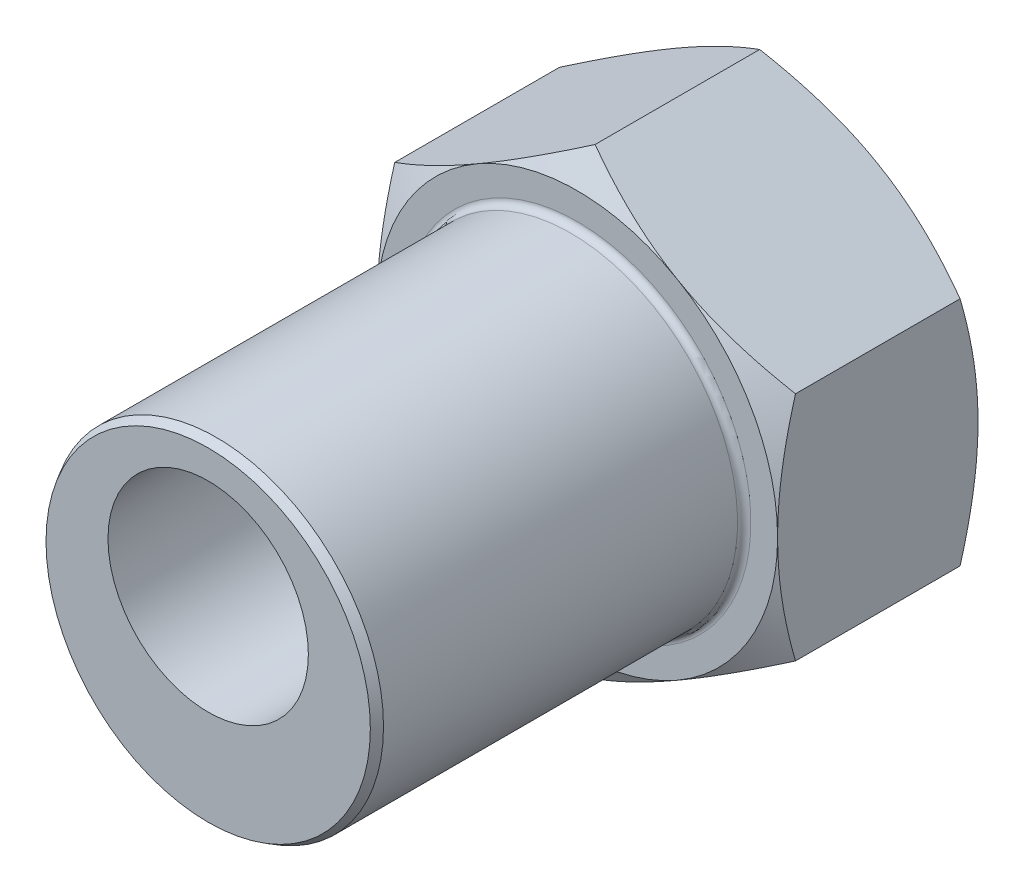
ISO-10303-21;
HEADER;
FILE_DESCRIPTION(('STEP AP214'),'2;1');
FILE_NAME('part.step','',(''),(''),'','','');
FILE_SCHEMA(('AUTOMOTIVE_DESIGN { 1 0 10303 214 1 1 1 1 }'));
ENDSEC;
DATA;
#1=APPLICATION_CONTEXT('core data for automotive mechanical design processes');
#2=APPLICATION_PROTOCOL_DEFINITION('international standard','automotive_design',2000,#1);
#3=PRODUCT_CONTEXT('',#1,'mechanical');
#4=PRODUCT('Part','Part','',(#3));
#5=PRODUCT_RELATED_PRODUCT_CATEGORY('part','',(#4));
#6=PRODUCT_DEFINITION_FORMATION('','',#4);
#7=PRODUCT_DEFINITION_CONTEXT('part definition',#1,'design');
#8=PRODUCT_DEFINITION('design','',#6,#7);
#9=PRODUCT_DEFINITION_SHAPE('','',#8);
#10=(LENGTH_UNIT() NAMED_UNIT(*) SI_UNIT(.MILLI.,.METRE.));
#11=(NAMED_UNIT(*) PLANE_ANGLE_UNIT() SI_UNIT($,.RADIAN.));
#12=(NAMED_UNIT(*) SI_UNIT($,.STERADIAN.) SOLID_ANGLE_UNIT());
#13=UNCERTAINTY_MEASURE_WITH_UNIT(LENGTH_MEASURE(1.E-05),#10,'distance_accuracy_value','');
#14=(GEOMETRIC_REPRESENTATION_CONTEXT(3) GLOBAL_UNCERTAINTY_ASSIGNED_CONTEXT((#13)) GLOBAL_UNIT_ASSIGNED_CONTEXT((#10,
#11,#12)) REPRESENTATION_CONTEXT('',''));
#15=CARTESIAN_POINT('',(0.,0.,0.));
#16=DIRECTION('',(0.,0.,1.));
#17=DIRECTION('',(1.,0.,0.));
#18=AXIS2_PLACEMENT_3D('',#15,#16,#17);
#19=CARTESIAN_POINT('',(-12.,4.92820323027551,12.));
#20=DIRECTION('',(-0.5,0.866025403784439,0.));
#21=DIRECTION('',(0.866025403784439,0.5,0.));
#22=AXIS2_PLACEMENT_3D('',#19,#20,#21);
#23=PLANE('',#22);
#24=DIRECTION('',(0.,0.,-1.));
#25=VECTOR('',#24,1.);
#26=CARTESIAN_POINT('',(0.,11.856406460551,12.));
#27=LINE('',#26,#25);
#28=CARTESIAN_POINT('',(0.,11.856406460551,10.9282032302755));
#29=VERTEX_POINT('',#28);
#30=CARTESIAN_POINT('',(0.,11.856406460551,1.07179676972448));
#31=VERTEX_POINT('',#30);
#32=EDGE_CURVE('E231',#29,#31,#27,.T.);
#33=ORIENTED_EDGE('',*,*,#32,.T.);
#34=CARTESIAN_POINT('',(0.000200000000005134,11.8565219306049,1.07186343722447));
#35=CARTESIAN_POINT('',(-0.263585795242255,11.7042251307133,0.983949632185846));
#36=CARTESIAN_POINT('',(-0.528355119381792,11.5513604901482,0.900025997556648));
#37=CARTESIAN_POINT('',(-1.06001701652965,11.244405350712,0.741266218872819));
#38=CARTESIAN_POINT('',(-1.32691025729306,11.0903144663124,0.666433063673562));
#39=CARTESIAN_POINT('',(-2.131890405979,10.6255589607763,0.457017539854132));
#40=CARTESIAN_POINT('',(-2.6731550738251,10.3130596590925,0.337903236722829));
#41=CARTESIAN_POINT('',(-3.48313282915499,9.84541878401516,0.198231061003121));
#42=CARTESIAN_POINT('',(-3.74942610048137,9.69167429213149,0.15844379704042));
#43=CARTESIAN_POINT('',(-4.28324559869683,9.38347346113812,0.0917233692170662));
#44=CARTESIAN_POINT('',(-4.55077184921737,9.2290171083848,0.0647904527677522));
#45=CARTESIAN_POINT('',(-5.08627036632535,8.91984689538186,0.0244685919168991));
#46=CARTESIAN_POINT('',(-5.35424172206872,8.76513356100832,0.0110635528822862));
#47=CARTESIAN_POINT('',(-5.89043273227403,8.45556353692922,-0.00191690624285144));
#48=CARTESIAN_POINT('',(-6.15865237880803,8.30070685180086,-0.00149275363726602));
#49=CARTESIAN_POINT('',(-6.6600893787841,8.01120206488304,0.0122200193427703));
#50=CARTESIAN_POINT('',(-6.89334249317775,7.87653331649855,0.0238359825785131));
#51=CARTESIAN_POINT('',(-7.35931224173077,7.60750555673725,0.0573080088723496));
#52=CARTESIAN_POINT('',(-7.59202883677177,7.47314656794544,0.0791647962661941));
#53=CARTESIAN_POINT('',(-8.05679907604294,7.20481134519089,0.132737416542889));
#54=CARTESIAN_POINT('',(-8.288852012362,7.07083551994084,0.164461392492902));
#55=CARTESIAN_POINT('',(-8.75186996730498,6.80351197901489,0.237211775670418));
#56=CARTESIAN_POINT('',(-8.98283491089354,6.67016430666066,0.278238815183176));
#57=CARTESIAN_POINT('',(-9.68394195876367,6.2653799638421,0.416311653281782));
#58=CARTESIAN_POINT('',(-10.1520537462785,5.99511549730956,0.527124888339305));
#59=CARTESIAN_POINT('',(-11.0812971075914,5.45861659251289,0.778625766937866));
#60=CARTESIAN_POINT('',(-11.5424405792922,5.19237528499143,0.919254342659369));
#61=CARTESIAN_POINT('',(-12.0002,4.92808776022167,1.07186343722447));
#62=B_SPLINE_CURVE_WITH_KNOTS('',3,(#34,#35,#36,#37,#38,#39,#40,#41,#42,#43,#44,#45,#46,#47,#48,
#49,#50,#51,#52,#53,#54,#55,#56,#57,#58,#59,#60,#61),.UNSPECIFIED.,.F.,.F.,(4,2,2,2,2,2,2,2,2,2,
2,2,2,4),(0.,0.951004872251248,1.90232158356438,3.80900466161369,4.73894551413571,
5.6689042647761,6.59775529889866,7.52657763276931,8.3351464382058,9.1437724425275,
9.95306755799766,10.7624176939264,12.4167102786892,14.0677556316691),.UNSPECIFIED.);
#63=CARTESIAN_POINT('',(-6.,8.39230484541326,0.));
#64=VERTEX_POINT('',#63);
#65=EDGE_CURVE('E36',#31,#64,#62,.T.);
#66=ORIENTED_EDGE('',*,*,#65,.T.);
#67=CARTESIAN_POINT('',(-12.,4.92820323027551,1.07179676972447));
#68=VERTEX_POINT('',#67);
#69=EDGE_CURVE('E187',#64,#68,#62,.T.);
#70=ORIENTED_EDGE('',*,*,#69,.T.);
#71=DIRECTION('',(0.,0.,-1.));
#72=VECTOR('',#71,1.);
#73=CARTESIAN_POINT('',(-12.,4.92820323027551,12.));
#74=LINE('',#73,#72);
#75=CARTESIAN_POINT('',(-12.,4.92820323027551,10.9282032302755));
#76=VERTEX_POINT('',#75);
#77=EDGE_CURVE('E235',#76,#68,#74,.T.);
#78=ORIENTED_EDGE('',*,*,#77,.F.);
#79=CARTESIAN_POINT('',(-12.0002,4.92808776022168,10.9281365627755));
#80=CARTESIAN_POINT('',(-11.7364142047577,5.08038456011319,11.0160503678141));
#81=CARTESIAN_POINT('',(-11.4716448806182,5.23324920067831,11.0999740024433));
#82=CARTESIAN_POINT('',(-10.9399829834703,5.54020434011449,11.2587337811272));
#83=CARTESIAN_POINT('',(-10.6730897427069,5.69429522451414,11.3335669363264));
#84=CARTESIAN_POINT('',(-9.86810959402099,6.15905073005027,11.5429824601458));
#85=CARTESIAN_POINT('',(-9.3268449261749,6.47155003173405,11.6620967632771));
#86=CARTESIAN_POINT('',(-8.516867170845,6.93919090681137,11.8017689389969));
#87=CARTESIAN_POINT('',(-8.25057389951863,7.09293539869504,11.8415562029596));
#88=CARTESIAN_POINT('',(-7.71675440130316,7.40113622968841,11.9082766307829));
#89=CARTESIAN_POINT('',(-7.44922815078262,7.55559258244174,11.9352095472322));
#90=CARTESIAN_POINT('',(-6.91372963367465,7.86476279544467,11.9755314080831));
#91=CARTESIAN_POINT('',(-6.64575827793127,8.01947612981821,11.9889364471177));
#92=CARTESIAN_POINT('',(-6.10956726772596,8.32904615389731,12.0019169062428));
#93=CARTESIAN_POINT('',(-5.84134762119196,8.48390283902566,12.0014927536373));
#94=CARTESIAN_POINT('',(-5.33991062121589,8.77340762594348,11.9877799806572));
#95=CARTESIAN_POINT('',(-5.10665750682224,8.90807637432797,11.9761640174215));
#96=CARTESIAN_POINT('',(-4.64068775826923,9.17710413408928,11.9426919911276));
#97=CARTESIAN_POINT('',(-4.40797116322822,9.31146312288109,11.9208352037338));
#98=CARTESIAN_POINT('',(-3.94320092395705,9.57979834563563,11.8672625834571));
#99=CARTESIAN_POINT('',(-3.71114798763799,9.71377417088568,11.8355386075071));
#100=CARTESIAN_POINT('',(-3.24813003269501,9.98109771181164,11.7627882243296));
#101=CARTESIAN_POINT('',(-3.01716508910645,10.1144453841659,11.7217611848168));
#102=CARTESIAN_POINT('',(-2.31605804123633,10.5192297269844,11.5836883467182));
#103=CARTESIAN_POINT('',(-1.84794625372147,10.789494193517,11.4728751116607));
#104=CARTESIAN_POINT('',(-0.918702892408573,11.3259930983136,11.2213742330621));
#105=CARTESIAN_POINT('',(-0.457559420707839,11.5922344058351,11.0807456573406));
#106=CARTESIAN_POINT('',(0.000200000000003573,11.8565219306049,10.9281365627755));
#107=B_SPLINE_CURVE_WITH_KNOTS('',3,(#79,#80,#81,#82,#83,#84,#85,#86,#87,#88,#89,#90,#91,#92,
#93,#94,#95,#96,#97,#98,#99,#100,#101,#102,#103,#104,#105,#106),.UNSPECIFIED.,.F.,.F.,(4,2,2,2,
2,2,2,2,2,2,2,2,2,4),(0.,0.951004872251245,1.90232158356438,3.80900466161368,4.7389455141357,
5.66890426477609,6.59775529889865,7.5265776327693,8.33514643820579,9.14377244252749,
9.95306755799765,10.7624176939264,12.4167102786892,14.0677556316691),.UNSPECIFIED.);
#108=CARTESIAN_POINT('',(-6.,8.39230484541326,12.));
#109=VERTEX_POINT('',#108);
#110=EDGE_CURVE('E284',#76,#109,#107,.T.);
#111=ORIENTED_EDGE('',*,*,#110,.T.);
#112=EDGE_CURVE('E277',#109,#29,#107,.T.);
#113=ORIENTED_EDGE('',*,*,#112,.T.);
#114=EDGE_LOOP('',(#33,#66,#70,#78,#111,#113));
#115=FACE_BOUND('',#114,.T.);
#116=ADVANCED_FACE('F14',(#115),#23,.T.);
#117=CARTESIAN_POINT('',(-12.,-8.92820323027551,12.));
#118=DIRECTION('',(-1.,0.,0.));
#119=DIRECTION('',(0.,1.,0.));
#120=AXIS2_PLACEMENT_3D('',#117,#118,#119);
#121=PLANE('',#120);
#122=ORIENTED_EDGE('',*,*,#77,.T.);
#123=CARTESIAN_POINT('',(-12.,-20.6907209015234,5.89551240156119));
#124=CARTESIAN_POINT('',(-12.,-20.4283357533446,5.76803839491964));
#125=CARTESIAN_POINT('',(-12.,-20.165644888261,5.64119395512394));
#126=CARTESIAN_POINT('',(-12.,-19.6395879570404,5.38890663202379));
#127=CARTESIAN_POINT('',(-12.,-19.3762218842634,5.26346376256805));
#128=CARTESIAN_POINT('',(-12.,-18.5849461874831,4.88941860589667));
#129=CARTESIAN_POINT('',(-12.,-18.0559354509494,4.64313697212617));
#130=CARTESIAN_POINT('',(-12.,-16.9915603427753,4.15692725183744));
#131=CARTESIAN_POINT('',(-12.,-16.4561771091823,3.91704035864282));
#132=CARTESIAN_POINT('',(-12.,-15.3811812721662,3.44697197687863));
#133=CARTESIAN_POINT('',(-12.,-14.8415688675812,3.21679003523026));
#134=CARTESIAN_POINT('',(-12.,-13.73950431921,2.7613608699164));
#135=CARTESIAN_POINT('',(-12.,-13.1768826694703,2.53652170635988));
#136=CARTESIAN_POINT('',(-12.,-12.0450829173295,2.10366452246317));
#137=CARTESIAN_POINT('',(-12.,-11.4759040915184,1.89564837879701));
#138=CARTESIAN_POINT('',(-12.,-10.3311424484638,1.50184236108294));
#139=CARTESIAN_POINT('',(-12.,-9.75557499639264,1.31600817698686));
#140=CARTESIAN_POINT('',(-12.,-8.59612958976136,0.972465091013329));
#141=CARTESIAN_POINT('',(-12.,-8.01225428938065,0.814747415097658));
#142=CARTESIAN_POINT('',(-12.,-7.13172782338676,0.605359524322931));
#143=CARTESIAN_POINT('',(-12.,-6.83825631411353,0.54023875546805));
#144=CARTESIAN_POINT('',(-12.,-6.24929310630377,0.419827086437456));
#145=CARTESIAN_POINT('',(-12.,-5.95380144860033,0.364535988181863));
#146=CARTESIAN_POINT('',(-12.,-5.36099570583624,0.264754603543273));
#147=CARTESIAN_POINT('',(-12.,-5.06368164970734,0.220264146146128));
#148=CARTESIAN_POINT('',(-12.,-4.46753962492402,0.142968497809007));
#149=CARTESIAN_POINT('',(-12.,-4.16871171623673,0.110162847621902));
#150=CARTESIAN_POINT('',(-12.,-3.57389611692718,0.0573043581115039));
#151=CARTESIAN_POINT('',(-12.,-3.27792295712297,0.03708900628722));
#152=CARTESIAN_POINT('',(-12.,-2.68538727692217,0.00919716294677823));
#153=CARTESIAN_POINT('',(-12.,-2.38882476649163,0.0015204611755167));
#154=CARTESIAN_POINT('',(-12.,-1.79564049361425,-0.00111118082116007));
#155=CARTESIAN_POINT('',(-12.,-1.49901873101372,0.00393391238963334));
#156=CARTESIAN_POINT('',(-12.,-0.906253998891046,0.0266217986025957));
#157=CARTESIAN_POINT('',(-12.,-0.610111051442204,0.0442651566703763));
#158=CARTESIAN_POINT('',(-12.,0.0991869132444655,0.10123418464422));
#159=CARTESIAN_POINT('',(-12.,0.511881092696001,0.14640240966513));
#160=CARTESIAN_POINT('',(-12.,1.33426197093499,0.258764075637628));
#161=CARTESIAN_POINT('',(-12.,1.74394826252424,0.325960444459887));
#162=CARTESIAN_POINT('',(-12.,2.55990416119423,0.479988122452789));
#163=CARTESIAN_POINT('',(-12.,2.96617089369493,0.566834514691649));
#164=CARTESIAN_POINT('',(-12.,3.77465614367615,0.757507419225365));
#165=CARTESIAN_POINT('',(-12.,4.17687471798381,0.8613336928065));
#166=CARTESIAN_POINT('',(-12.,4.98614639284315,1.08589932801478));
#167=CARTESIAN_POINT('',(-12.,5.39310897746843,1.2069626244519));
#168=CARTESIAN_POINT('',(-12.,6.20302630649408,1.46175759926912));
#169=CARTESIAN_POINT('',(-12.,6.60598102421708,1.59548936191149));
#170=CARTESIAN_POINT('',(-12.,7.40807885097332,1.8734839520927));
#171=CARTESIAN_POINT('',(-12.,7.80722314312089,2.0177433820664));
#172=CARTESIAN_POINT('',(-12.,8.60219382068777,2.31508049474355));
#173=CARTESIAN_POINT('',(-12.,8.99802024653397,2.46815806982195));
#174=CARTESIAN_POINT('',(-12.,9.9379200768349,2.84177061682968));
#175=CARTESIAN_POINT('',(-12.,10.4806543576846,3.06566951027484));
#176=CARTESIAN_POINT('',(-12.,11.5614415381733,3.52452732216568));
#177=CARTESIAN_POINT('',(-12.,12.0994941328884,3.75948695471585));
#178=CARTESIAN_POINT('',(-12.,13.1717982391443,4.23823325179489));
#179=CARTESIAN_POINT('',(-12.,13.7060488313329,4.48202196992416));
#180=CARTESIAN_POINT('',(-12.,14.7712628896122,4.97662948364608));
#181=CARTESIAN_POINT('',(-12.,15.3022264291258,5.22744812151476));
#182=CARTESIAN_POINT('',(-12.,16.3620156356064,5.73507745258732));
#183=CARTESIAN_POINT('',(-12.,16.8908382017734,5.99189460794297));
#184=CARTESIAN_POINT('',(-12.,17.9461814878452,6.51021493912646));
#185=CARTESIAN_POINT('',(-12.,18.4727021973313,6.77171813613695));
#186=CARTESIAN_POINT('',(-12.,19.5237272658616,7.29856566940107));
#187=CARTESIAN_POINT('',(-12.,20.0482318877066,7.56390948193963));
#188=CARTESIAN_POINT('',(-12.,21.0955889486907,8.09783982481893));
#189=CARTESIAN_POINT('',(-12.,21.618441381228,8.36642636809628));
#190=CARTESIAN_POINT('',(-12.,23.0960400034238,9.1303325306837));
#191=CARTESIAN_POINT('',(-12.,24.049134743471,9.62884639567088));
#192=CARTESIAN_POINT('',(-12.,25.9517745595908,10.632671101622));
#193=CARTESIAN_POINT('',(-12.,26.9013195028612,11.1379821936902));
#194=CARTESIAN_POINT('',(-12.,28.7951912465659,12.15249723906));
#195=CARTESIAN_POINT('',(-12.,29.7395251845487,12.6616878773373));
#196=CARTESIAN_POINT('',(-12.,31.1543546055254,13.4284905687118));
#197=CARTESIAN_POINT('',(-12.,31.6256727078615,13.6845870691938));
#198=CARTESIAN_POINT('',(-12.,32.56781528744,14.1976847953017));
#199=CARTESIAN_POINT('',(-12.,33.0386397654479,14.454686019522));
#200=CARTESIAN_POINT('',(-12.,33.5092455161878,14.7120872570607));
#201=B_SPLINE_CURVE_WITH_KNOTS('',3,(#123,#124,#125,#126,#127,#128,#129,#130,#131,#132,#133,
#134,#135,#136,#137,#138,#139,#140,#141,#142,#143,#144,#145,#146,#147,#148,#149,#150,#151,#152,
#153,#154,#155,#156,#157,#158,#159,#160,#161,#162,#163,#164,#165,#166,#167,#168,#169,#170,#171,
#172,#173,#174,#175,#176,#177,#178,#179,#180,#181,#182,#183,#184,#185,#186,#187,#188,#189,#190,
#191,#192,#193,#194,#195,#196,#197,#198,#199,#200),.UNSPECIFIED.,.F.,.F.,(4,2,2,2,2,2,2,2,2,2,2,
2,2,2,2,2,2,2,2,2,2,2,2,2,2,2,2,2,2,2,2,2,2,2,2,2,2,2,4),(0.,0.875132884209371,1.75027440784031,
3.50081227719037,5.26074523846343,7.02059594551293,8.83804337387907,10.6556932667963,
12.4696492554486,14.2830381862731,15.1847295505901,16.0864027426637,16.9880616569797,
17.8896851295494,18.7794154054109,19.6691307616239,20.5588484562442,21.4486060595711,
22.6933948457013,23.9383491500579,25.1842623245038,26.4301579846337,27.70367547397,
28.9772014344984,30.2503181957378,31.5234194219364,33.2845644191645,35.0458232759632,
36.807494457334,38.5691261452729,40.3327521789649,42.0963861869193,43.8597819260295,
45.6231847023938,48.8499295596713,52.0767939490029,55.2953788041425,56.9045814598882,
58.5137816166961),.UNSPECIFIED.);
#202=CARTESIAN_POINT('',(-12.,-2.,0.));
#203=VERTEX_POINT('',#202);
#204=EDGE_CURVE('E185',#68,#203,#201,.F.);
#205=ORIENTED_EDGE('',*,*,#204,.T.);
#206=CARTESIAN_POINT('',(-12.,-8.92820323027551,1.07179676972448));
#207=VERTEX_POINT('',#206);
#208=EDGE_CURVE('E178',#203,#207,#201,.F.);
#209=ORIENTED_EDGE('',*,*,#208,.T.);
#210=DIRECTION('',(0.,0.,-1.));
#211=VECTOR('',#210,1.);
#212=CARTESIAN_POINT('',(-12.,-8.92820323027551,12.));
#213=LINE('',#212,#211);
#214=CARTESIAN_POINT('',(-12.,-8.92820323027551,10.9282032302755));
#215=VERTEX_POINT('',#214);
#216=EDGE_CURVE('E239',#215,#207,#213,.T.);
#217=ORIENTED_EDGE('',*,*,#216,.F.);
#218=CARTESIAN_POINT('',(-12.,-20.5602556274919,6.16780761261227));
#219=CARTESIAN_POINT('',(-12.,-20.2984177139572,6.29475460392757));
#220=CARTESIAN_POINT('',(-12.,-20.0362712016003,6.42106478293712));
#221=CARTESIAN_POINT('',(-12.,-19.511296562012,6.67226719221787));
#222=CARTESIAN_POINT('',(-12.,-19.2484684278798,6.79715940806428));
#223=CARTESIAN_POINT('',(-12.,-18.4587942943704,7.16952585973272));
#224=CARTESIAN_POINT('',(-12.,-17.9308367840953,7.41465187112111));
#225=CARTESIAN_POINT('',(-12.,-16.8684748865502,7.89848067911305));
#226=CARTESIAN_POINT('',(-12.,-16.334051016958,8.1371408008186));
#227=CARTESIAN_POINT('',(-12.,-15.2609358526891,8.60463171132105));
#228=CARTESIAN_POINT('',(-12.,-14.7222447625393,8.83346296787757));
#229=CARTESIAN_POINT('',(-12.,-13.6225243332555,9.28577357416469));
#230=CARTESIAN_POINT('',(-12.,-13.0613291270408,9.50885175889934));
#231=CARTESIAN_POINT('',(-12.,-11.932350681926,9.93800471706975));
#232=CARTESIAN_POINT('',(-12.,-11.3645667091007,10.1440775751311));
#233=CARTESIAN_POINT('',(-12.,-10.2226050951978,10.5337704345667));
#234=CARTESIAN_POINT('',(-12.,-9.64844324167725,10.7174363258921));
#235=CARTESIAN_POINT('',(-12.,-8.4918290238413,11.0563988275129));
#236=CARTESIAN_POINT('',(-12.,-7.90937934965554,11.2117044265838));
#237=CARTESIAN_POINT('',(-12.,-7.03100430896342,11.4173232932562));
#238=CARTESIAN_POINT('',(-12.,-6.73822745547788,11.4811702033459));
#239=CARTESIAN_POINT('',(-12.,-6.15068261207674,11.5989859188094));
#240=CARTESIAN_POINT('',(-12.,-5.85591466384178,11.6529549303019));
#241=CARTESIAN_POINT('',(-12.,-5.26459407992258,11.7500592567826));
#242=CARTESIAN_POINT('',(-12.,-4.96804146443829,11.7931946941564));
#243=CARTESIAN_POINT('',(-12.,-4.3734703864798,11.8677694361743));
#244=CARTESIAN_POINT('',(-12.,-4.07545198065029,11.8992091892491));
#245=CARTESIAN_POINT('',(-12.,-3.48223440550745,11.9493766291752));
#246=CARTESIAN_POINT('',(-12.,-3.18704881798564,11.9682639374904));
#247=CARTESIAN_POINT('',(-12.,-2.59614424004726,11.9935419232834));
#248=CARTESIAN_POINT('',(-12.,-2.3004252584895,11.9999328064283));
#249=CARTESIAN_POINT('',(-12.,-1.70898117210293,12.00006612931));
#250=CARTESIAN_POINT('',(-12.,-1.41325606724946,11.9938084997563));
#251=CARTESIAN_POINT('',(-12.,-0.822331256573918,11.9687965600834));
#252=CARTESIAN_POINT('',(-12.,-0.527131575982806,11.9500416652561));
#253=CARTESIAN_POINT('',(-12.,0.183852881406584,11.890216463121));
#254=CARTESIAN_POINT('',(-12.,0.599140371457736,11.84313183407));
#255=CARTESIAN_POINT('',(-12.,1.42660267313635,11.7268057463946));
#256=CARTESIAN_POINT('',(-12.,1.83877704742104,11.6575612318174));
#257=CARTESIAN_POINT('',(-12.,2.65963118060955,11.499378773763));
#258=CARTESIAN_POINT('',(-12.,3.06830791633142,11.4104252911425));
#259=CARTESIAN_POINT('',(-12.,3.881546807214,11.2155366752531));
#260=CARTESIAN_POINT('',(-12.,4.28610902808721,11.1096018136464));
#261=CARTESIAN_POINT('',(-12.,5.09995591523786,10.8808381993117));
#262=CARTESIAN_POINT('',(-12.,5.50915034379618,10.7576906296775));
#263=CARTESIAN_POINT('',(-12.,6.3235077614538,10.4987854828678));
#264=CARTESIAN_POINT('',(-12.,6.7286707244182,10.3630278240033));
#265=CARTESIAN_POINT('',(-12.,7.53516715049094,10.0810480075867));
#266=CARTESIAN_POINT('',(-12.,7.93650186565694,9.93482941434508));
#267=CARTESIAN_POINT('',(-12.,8.73585367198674,9.63363672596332));
#268=CARTESIAN_POINT('',(-12.,9.13387079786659,9.4786627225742));
#269=CARTESIAN_POINT('',(-12.,10.0558047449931,9.10987467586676));
#270=CARTESIAN_POINT('',(-12.,10.5786159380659,8.89330121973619));
#271=CARTESIAN_POINT('',(-12.,11.6199242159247,8.44999149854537));
#272=CARTESIAN_POINT('',(-12.,12.1384210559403,8.22325466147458));
#273=CARTESIAN_POINT('',(-12.,13.1718803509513,7.76160431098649));
#274=CARTESIAN_POINT('',(-12.,13.6868420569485,7.52668912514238));
#275=CARTESIAN_POINT('',(-12.,14.7136991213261,7.05029102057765));
#276=CARTESIAN_POINT('',(-12.,15.2255945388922,6.80880822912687));
#277=CARTESIAN_POINT('',(-12.,16.2473410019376,6.32022368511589));
#278=CARTESIAN_POINT('',(-12.,16.7571893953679,6.07311639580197));
#279=CARTESIAN_POINT('',(-12.,17.7747117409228,5.57446581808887));
#280=CARTESIAN_POINT('',(-12.,18.2823856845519,5.32292251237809));
#281=CARTESIAN_POINT('',(-12.,19.295825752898,4.81617487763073));
#282=CARTESIAN_POINT('',(-12.,19.8015920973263,4.56097098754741));
#283=CARTESIAN_POINT('',(-12.,20.8115477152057,4.04745979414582));
#284=CARTESIAN_POINT('',(-12.,21.3157369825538,3.78915247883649));
#285=CARTESIAN_POINT('',(-12.,22.7446187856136,3.05241209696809));
#286=CARTESIAN_POINT('',(-12.,23.6677077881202,2.57086900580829));
#287=CARTESIAN_POINT('',(-12.,25.51042540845,1.60115012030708));
#288=CARTESIAN_POINT('',(-12.,26.4300539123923,1.11297411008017));
#289=CARTESIAN_POINT('',(-12.,28.2644096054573,0.132686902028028));
#290=CARTESIAN_POINT('',(-12.,29.1791432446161,-0.35941223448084));
#291=CARTESIAN_POINT('',(-12.,30.5496022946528,-1.10053563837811));
#292=CARTESIAN_POINT('',(-12.,31.0061367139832,-1.34806616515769));
#293=CARTESIAN_POINT('',(-12.,31.9187192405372,-1.84402042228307));
#294=CARTESIAN_POINT('',(-12.,32.3747673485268,-2.09244415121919));
#295=CARTESIAN_POINT('',(-12.,32.8305994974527,-2.34126362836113));
#296=B_SPLINE_CURVE_WITH_KNOTS('',3,(#218,#219,#220,#221,#222,#223,#224,#225,#226,#227,#228,
#229,#230,#231,#232,#233,#234,#235,#236,#237,#238,#239,#240,#241,#242,#243,#244,#245,#246,#247,
#248,#249,#250,#251,#252,#253,#254,#255,#256,#257,#258,#259,#260,#261,#262,#263,#264,#265,#266,
#267,#268,#269,#270,#271,#272,#273,#274,#275,#276,#277,#278,#279,#280,#281,#282,#283,#284,#285,
#286,#287,#288,#289,#290,#291,#292,#293,#294,#295),.UNSPECIFIED.,.F.,.F.,(4,2,2,2,2,2,2,2,2,2,2,
2,2,2,2,2,2,2,2,2,2,2,2,2,2,2,2,2,2,2,2,2,2,2,2,2,2,2,4),(0.,0.872965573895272,1.74594002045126,
3.49214982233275,5.24795078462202,7.0036680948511,8.81517937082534,10.6268944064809,
12.434834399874,14.2422003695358,15.1410336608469,16.0398481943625,16.9386525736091,
17.8374224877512,18.72453272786,19.6116283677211,20.4987288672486,21.3858708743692,
22.6390207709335,23.8923435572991,25.146658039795,26.4009524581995,27.6826799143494,
28.9644156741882,30.2457167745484,31.5270044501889,33.224541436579,34.9221740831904,
36.6201559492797,38.3181049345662,40.0178046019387,41.7175109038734,43.4170150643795,
45.1165257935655,48.2399117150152,51.3633995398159,54.4794882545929,56.0374526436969,
57.59541457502),.UNSPECIFIED.);
#297=CARTESIAN_POINT('',(-12.,-2.,12.));
#298=VERTEX_POINT('',#297);
#299=EDGE_CURVE('E212',#215,#298,#296,.T.);
#300=ORIENTED_EDGE('',*,*,#299,.T.);
#301=EDGE_CURVE('E204',#298,#76,#296,.T.);
#302=ORIENTED_EDGE('',*,*,#301,.T.);
#303=EDGE_LOOP('',(#122,#205,#209,#217,#300,#302));
#304=FACE_BOUND('',#303,.T.);
#305=ADVANCED_FACE('F194',(#304),#121,.T.);
#306=CARTESIAN_POINT('',(0.,-15.856406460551,12.));
#307=DIRECTION('',(-0.5,-0.866025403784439,0.));
#308=DIRECTION('',(-0.866025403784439,0.5,0.));
#309=AXIS2_PLACEMENT_3D('',#306,#307,#308);
#310=PLANE('',#309);
#311=ORIENTED_EDGE('',*,*,#216,.T.);
#312=CARTESIAN_POINT('',(-12.0002,-8.92808776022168,1.07186343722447));
#313=CARTESIAN_POINT('',(-11.7364142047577,-9.08038456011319,0.983949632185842));
#314=CARTESIAN_POINT('',(-11.4716448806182,-9.2332492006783,0.900025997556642));
#315=CARTESIAN_POINT('',(-10.9399829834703,-9.54020434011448,0.74126621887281));
#316=CARTESIAN_POINT('',(-10.6730897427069,-9.69429522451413,0.666433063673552));
#317=CARTESIAN_POINT('',(-9.86810959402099,-10.1590507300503,0.457017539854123));
#318=CARTESIAN_POINT('',(-9.3268449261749,-10.471550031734,0.337903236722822));
#319=CARTESIAN_POINT('',(-8.516867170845,-10.9391909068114,0.198231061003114));
#320=CARTESIAN_POINT('',(-8.25057389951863,-11.092935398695,0.158443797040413));
#321=CARTESIAN_POINT('',(-7.71675440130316,-11.4011362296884,0.0917233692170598));
#322=CARTESIAN_POINT('',(-7.44922815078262,-11.5555925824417,0.0647904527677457));
#323=CARTESIAN_POINT('',(-6.91372963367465,-11.8647627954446,0.0244685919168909));
#324=CARTESIAN_POINT('',(-6.64575827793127,-12.0194761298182,0.0110635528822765));
#325=CARTESIAN_POINT('',(-6.10956726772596,-12.3290461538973,-0.0019169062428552));
#326=CARTESIAN_POINT('',(-5.84134762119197,-12.4839028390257,-0.00149275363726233));
#327=CARTESIAN_POINT('',(-5.3399106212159,-12.7734076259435,0.012220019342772));
#328=CARTESIAN_POINT('',(-5.10665750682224,-12.908076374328,0.0238359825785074));
#329=CARTESIAN_POINT('',(-4.64068775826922,-13.1771041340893,0.0573080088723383));
#330=CARTESIAN_POINT('',(-4.40797116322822,-13.3114631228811,0.0791647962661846));
#331=CARTESIAN_POINT('',(-3.94320092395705,-13.5797983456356,0.132737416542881));
#332=CARTESIAN_POINT('',(-3.71114798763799,-13.7137741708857,0.164461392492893));
#333=CARTESIAN_POINT('',(-3.24813003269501,-13.9810977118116,0.23721177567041));
#334=CARTESIAN_POINT('',(-3.01716508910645,-14.1144453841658,0.278238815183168));
#335=CARTESIAN_POINT('',(-2.31605804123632,-14.5192297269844,0.416311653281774));
#336=CARTESIAN_POINT('',(-1.84794625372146,-14.789494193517,0.527124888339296));
#337=CARTESIAN_POINT('',(-0.918702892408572,-15.3259930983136,0.778625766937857));
#338=CARTESIAN_POINT('',(-0.457559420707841,-15.5922344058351,0.919254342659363));
#339=CARTESIAN_POINT('',(0.000199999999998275,-15.8565219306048,1.07186343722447));
#340=B_SPLINE_CURVE_WITH_KNOTS('',3,(#312,#313,#314,#315,#316,#317,#318,#319,#320,#321,#322,
#323,#324,#325,#326,#327,#328,#329,#330,#331,#332,#333,#334,#335,#336,#337,#338,#339),
.UNSPECIFIED.,.F.,.F.,(4,2,2,2,2,2,2,2,2,2,2,2,2,4),(0.,0.951004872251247,1.90232158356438,
3.80900466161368,4.7389455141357,5.66890426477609,6.59775529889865,7.5265776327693,
8.33514643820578,9.14377244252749,9.95306755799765,10.7624176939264,12.4167102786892,
14.0677556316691),.UNSPECIFIED.);
#341=CARTESIAN_POINT('',(-6.,-12.3923048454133,0.));
#342=VERTEX_POINT('',#341);
#343=EDGE_CURVE('E186',#207,#342,#340,.T.);
#344=ORIENTED_EDGE('',*,*,#343,.T.);
#345=CARTESIAN_POINT('',(0.,-15.856406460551,1.07179676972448));
#346=VERTEX_POINT('',#345);
#347=EDGE_CURVE('E171',#342,#346,#340,.T.);
#348=ORIENTED_EDGE('',*,*,#347,.T.);
#349=DIRECTION('',(0.,0.,-1.));
#350=VECTOR('',#349,1.);
#351=CARTESIAN_POINT('',(0.,-15.856406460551,12.));
#352=LINE('',#351,#350);
#353=CARTESIAN_POINT('',(0.,-15.856406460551,10.9282032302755));
#354=VERTEX_POINT('',#353);
#355=EDGE_CURVE('E242',#354,#346,#352,.T.);
#356=ORIENTED_EDGE('',*,*,#355,.F.);
#357=CARTESIAN_POINT('',(0.000199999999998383,-15.8565219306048,10.9281365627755));
#358=CARTESIAN_POINT('',(-0.26358579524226,-15.7042251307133,11.0160503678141));
#359=CARTESIAN_POINT('',(-0.528355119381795,-15.5513604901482,11.0999740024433));
#360=CARTESIAN_POINT('',(-1.06001701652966,-15.244405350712,11.2587337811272));
#361=CARTESIAN_POINT('',(-1.32691025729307,-15.0903144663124,11.3335669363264));
#362=CARTESIAN_POINT('',(-2.13189040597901,-14.6255589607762,11.5429824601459));
#363=CARTESIAN_POINT('',(-2.6731550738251,-14.3130596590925,11.6620967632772));
#364=CARTESIAN_POINT('',(-3.48313282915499,-13.8454187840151,11.8017689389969));
#365=CARTESIAN_POINT('',(-3.74942610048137,-13.6916742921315,11.8415562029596));
#366=CARTESIAN_POINT('',(-4.28324559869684,-13.3834734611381,11.9082766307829));
#367=CARTESIAN_POINT('',(-4.55077184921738,-13.2290171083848,11.9352095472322));
#368=CARTESIAN_POINT('',(-5.08627036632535,-12.9198468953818,11.9755314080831));
#369=CARTESIAN_POINT('',(-5.35424172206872,-12.7651335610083,11.9889364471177));
#370=CARTESIAN_POINT('',(-5.89043273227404,-12.4555635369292,12.0019169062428));
#371=CARTESIAN_POINT('',(-6.15865237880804,-12.3007068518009,12.0014927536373));
#372=CARTESIAN_POINT('',(-6.66008937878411,-12.011202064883,11.9877799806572));
#373=CARTESIAN_POINT('',(-6.89334249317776,-11.8765333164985,11.9761640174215));
#374=CARTESIAN_POINT('',(-7.35931224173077,-11.6075055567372,11.9426919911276));
#375=CARTESIAN_POINT('',(-7.59202883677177,-11.4731465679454,11.9208352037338));
#376=CARTESIAN_POINT('',(-8.05679907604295,-11.2048113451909,11.8672625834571));
#377=CARTESIAN_POINT('',(-8.28885201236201,-11.0708355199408,11.8355386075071));
#378=CARTESIAN_POINT('',(-8.75186996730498,-10.8035119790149,11.7627882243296));
#379=CARTESIAN_POINT('',(-8.98283491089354,-10.6701643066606,11.7217611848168));
#380=CARTESIAN_POINT('',(-9.68394195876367,-10.2653799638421,11.5836883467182));
#381=CARTESIAN_POINT('',(-10.1520537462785,-9.99511549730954,11.4728751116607));
#382=CARTESIAN_POINT('',(-11.0812971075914,-9.45861659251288,11.2213742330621));
#383=CARTESIAN_POINT('',(-11.5424405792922,-9.19237528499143,11.0807456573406));
#384=CARTESIAN_POINT('',(-12.0002,-8.92808776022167,10.9281365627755));
#385=B_SPLINE_CURVE_WITH_KNOTS('',3,(#357,#358,#359,#360,#361,#362,#363,#364,#365,#366,#367,
#368,#369,#370,#371,#372,#373,#374,#375,#376,#377,#378,#379,#380,#381,#382,#383,#384),
.UNSPECIFIED.,.F.,.F.,(4,2,2,2,2,2,2,2,2,2,2,2,2,4),(0.,0.951004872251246,1.90232158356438,
3.80900466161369,4.7389455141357,5.66890426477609,6.59775529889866,7.52657763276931,
8.33514643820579,9.1437724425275,9.95306755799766,10.7624176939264,12.4167102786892,
14.0677556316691),.UNSPECIFIED.);
#386=CARTESIAN_POINT('',(-6.,-12.3923048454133,12.));
#387=VERTEX_POINT('',#386);
#388=EDGE_CURVE('E226',#354,#387,#385,.T.);
#389=ORIENTED_EDGE('',*,*,#388,.T.);
#390=EDGE_CURVE('E219',#387,#215,#385,.T.);
#391=ORIENTED_EDGE('',*,*,#390,.T.);
#392=EDGE_LOOP('',(#311,#344,#348,#356,#389,#391));
#393=FACE_BOUND('',#392,.T.);
#394=ADVANCED_FACE('F198',(#393),#310,.T.);
#395=CARTESIAN_POINT('',(12.,-8.92820323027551,12.));
#396=DIRECTION('',(0.5,-0.866025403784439,0.));
#397=DIRECTION('',(-0.866025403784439,-0.5,0.));
#398=AXIS2_PLACEMENT_3D('',#395,#396,#397);
#399=PLANE('',#398);
#400=ORIENTED_EDGE('',*,*,#355,.T.);
#401=CARTESIAN_POINT('',(-0.000200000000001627,-15.8565219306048,1.07186343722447));
#402=CARTESIAN_POINT('',(0.263585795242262,-15.7042251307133,0.983949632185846));
#403=CARTESIAN_POINT('',(0.5283551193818,-15.5513604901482,0.900025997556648));
#404=CARTESIAN_POINT('',(1.06001701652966,-15.244405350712,0.741266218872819));
#405=CARTESIAN_POINT('',(1.32691025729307,-15.0903144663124,0.66643306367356));
#406=CARTESIAN_POINT('',(2.13189040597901,-14.6255589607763,0.457017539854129));
#407=CARTESIAN_POINT('',(2.6731550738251,-14.3130596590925,0.337903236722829));
#408=CARTESIAN_POINT('',(3.48313282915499,-13.8454187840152,0.198231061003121));
#409=CARTESIAN_POINT('',(3.74942610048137,-13.6916742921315,0.15844379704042));
#410=CARTESIAN_POINT('',(4.28324559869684,-13.3834734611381,0.0917233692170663));
#411=CARTESIAN_POINT('',(4.55077184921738,-13.2290171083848,0.064790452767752));
#412=CARTESIAN_POINT('',(5.08627036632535,-12.9198468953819,0.0244685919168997));
#413=CARTESIAN_POINT('',(5.35424172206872,-12.7651335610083,0.0110635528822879));
#414=CARTESIAN_POINT('',(5.89043273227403,-12.4555635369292,-0.00191690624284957));
#415=CARTESIAN_POINT('',(6.15865237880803,-12.3007068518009,-0.00149275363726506));
#416=CARTESIAN_POINT('',(6.6600893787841,-12.011202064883,0.0122200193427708));
#417=CARTESIAN_POINT('',(6.89334249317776,-11.8765333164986,0.0238359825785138));
#418=CARTESIAN_POINT('',(7.35931224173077,-11.6075055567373,0.0573080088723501));
#419=CARTESIAN_POINT('',(7.59202883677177,-11.4731465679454,0.079164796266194));
#420=CARTESIAN_POINT('',(8.05679907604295,-11.2048113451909,0.132737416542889));
#421=CARTESIAN_POINT('',(8.28885201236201,-11.0708355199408,0.164461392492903));
#422=CARTESIAN_POINT('',(8.75186996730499,-10.8035119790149,0.23721177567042));
#423=CARTESIAN_POINT('',(8.98283491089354,-10.6701643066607,0.278238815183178));
#424=CARTESIAN_POINT('',(9.68394195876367,-10.2653799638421,0.416311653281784));
#425=CARTESIAN_POINT('',(10.1520537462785,-9.99511549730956,0.527124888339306));
#426=CARTESIAN_POINT('',(11.0812971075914,-9.45861659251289,0.778625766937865));
#427=CARTESIAN_POINT('',(11.5424405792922,-9.19237528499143,0.919254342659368));
#428=CARTESIAN_POINT('',(12.0002,-8.92808776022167,1.07186343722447));
#429=B_SPLINE_CURVE_WITH_KNOTS('',3,(#401,#402,#403,#404,#405,#406,#407,#408,#409,#410,#411,
#412,#413,#414,#415,#416,#417,#418,#419,#420,#421,#422,#423,#424,#425,#426,#427,#428),
.UNSPECIFIED.,.F.,.F.,(4,2,2,2,2,2,2,2,2,2,2,2,2,4),(0.,0.951004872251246,1.90232158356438,
3.80900466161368,4.7389455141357,5.66890426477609,6.59775529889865,7.5265776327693,
8.33514643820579,9.14377244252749,9.95306755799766,10.7624176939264,12.4167102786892,
14.0677556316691),.UNSPECIFIED.);
#430=CARTESIAN_POINT('',(6.,-12.3923048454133,0.));
#431=VERTEX_POINT('',#430);
#432=EDGE_CURVE('E137',#346,#431,#429,.T.);
#433=ORIENTED_EDGE('',*,*,#432,.T.);
#434=CARTESIAN_POINT('',(12.,-8.92820323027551,1.07179676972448));
#435=VERTEX_POINT('',#434);
#436=EDGE_CURVE('E122',#431,#435,#429,.T.);
#437=ORIENTED_EDGE('',*,*,#436,.T.);
#438=DIRECTION('',(0.,0.,-1.));
#439=VECTOR('',#438,1.);
#440=CARTESIAN_POINT('',(12.,-8.92820323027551,12.));
#441=LINE('',#440,#439);
#442=CARTESIAN_POINT('',(12.,-8.92820323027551,10.9282032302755));
#443=VERTEX_POINT('',#442);
#444=EDGE_CURVE('E136',#443,#435,#441,.T.);
#445=ORIENTED_EDGE('',*,*,#444,.F.);
#446=CARTESIAN_POINT('',(12.0002,-8.92808776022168,10.9281365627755));
#447=CARTESIAN_POINT('',(11.7364142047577,-9.0803845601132,11.0160503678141));
#448=CARTESIAN_POINT('',(11.4716448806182,-9.23324920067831,11.0999740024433));
#449=CARTESIAN_POINT('',(10.9399829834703,-9.5402043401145,11.2587337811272));
#450=CARTESIAN_POINT('',(10.6730897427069,-9.69429522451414,11.3335669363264));
#451=CARTESIAN_POINT('',(9.86810959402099,-10.1590507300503,11.5429824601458));
#452=CARTESIAN_POINT('',(9.3268449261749,-10.471550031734,11.6620967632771));
#453=CARTESIAN_POINT('',(8.51686717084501,-10.9391909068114,11.8017689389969));
#454=CARTESIAN_POINT('',(8.25057389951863,-11.092935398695,11.8415562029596));
#455=CARTESIAN_POINT('',(7.71675440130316,-11.4011362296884,11.9082766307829));
#456=CARTESIAN_POINT('',(7.44922815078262,-11.5555925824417,11.9352095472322));
#457=CARTESIAN_POINT('',(6.91372963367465,-11.8647627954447,11.9755314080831));
#458=CARTESIAN_POINT('',(6.64575827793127,-12.0194761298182,11.9889364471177));
#459=CARTESIAN_POINT('',(6.10956726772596,-12.3290461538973,12.0019169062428));
#460=CARTESIAN_POINT('',(5.84134762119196,-12.4839028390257,12.0014927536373));
#461=CARTESIAN_POINT('',(5.33991062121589,-12.7734076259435,11.9877799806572));
#462=CARTESIAN_POINT('',(5.10665750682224,-12.908076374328,11.9761640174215));
#463=CARTESIAN_POINT('',(4.64068775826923,-13.1771041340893,11.9426919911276));
#464=CARTESIAN_POINT('',(4.40797116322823,-13.3114631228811,11.9208352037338));
#465=CARTESIAN_POINT('',(3.94320092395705,-13.5797983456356,11.8672625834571));
#466=CARTESIAN_POINT('',(3.711147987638,-13.7137741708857,11.8355386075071));
#467=CARTESIAN_POINT('',(3.24813003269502,-13.9810977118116,11.7627882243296));
#468=CARTESIAN_POINT('',(3.01716508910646,-14.1144453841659,11.7217611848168));
#469=CARTESIAN_POINT('',(2.31605804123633,-14.5192297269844,11.5836883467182));
#470=CARTESIAN_POINT('',(1.84794625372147,-14.789494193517,11.4728751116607));
#471=CARTESIAN_POINT('',(0.918702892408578,-15.3259930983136,11.2213742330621));
#472=CARTESIAN_POINT('',(0.457559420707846,-15.5922344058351,11.0807456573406));
#473=CARTESIAN_POINT('',(-0.00020000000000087,-15.8565219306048,10.9281365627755));
#474=B_SPLINE_CURVE_WITH_KNOTS('',3,(#446,#447,#448,#449,#450,#451,#452,#453,#454,#455,#456,
#457,#458,#459,#460,#461,#462,#463,#464,#465,#466,#467,#468,#469,#470,#471,#472,#473),
.UNSPECIFIED.,.F.,.F.,(4,2,2,2,2,2,2,2,2,2,2,2,2,4),(0.,0.951004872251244,1.90232158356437,
3.80900466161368,4.7389455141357,5.66890426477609,6.59775529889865,7.5265776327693,
8.33514643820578,9.14377244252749,9.95306755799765,10.7624176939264,12.4167102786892,
14.0677556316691),.UNSPECIFIED.);
#475=CARTESIAN_POINT('',(6.,-12.3923048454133,12.));
#476=VERTEX_POINT('',#475);
#477=EDGE_CURVE('E213',#443,#476,#474,.T.);
#478=ORIENTED_EDGE('',*,*,#477,.T.);
#479=EDGE_CURVE('E227',#476,#354,#474,.T.);
#480=ORIENTED_EDGE('',*,*,#479,.T.);
#481=EDGE_LOOP('',(#400,#433,#437,#445,#478,#480));
#482=FACE_BOUND('',#481,.T.);
#483=ADVANCED_FACE('F334',(#482),#399,.T.);
#484=CARTESIAN_POINT('',(12.,4.92820323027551,12.));
#485=DIRECTION('',(1.,0.,0.));
#486=DIRECTION('',(0.,-1.,0.));
#487=AXIS2_PLACEMENT_3D('',#484,#485,#486);
#488=PLANE('',#487);
#489=ORIENTED_EDGE('',*,*,#444,.T.);
#490=CARTESIAN_POINT('',(12.,-20.6907209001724,5.89551240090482));
#491=CARTESIAN_POINT('',(12.,-20.4283357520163,5.76803839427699));
#492=CARTESIAN_POINT('',(12.,-20.1656448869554,5.64119395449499));
#493=CARTESIAN_POINT('',(12.,-19.6395879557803,5.38890663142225));
#494=CARTESIAN_POINT('',(12.,-19.376221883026,5.2634637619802));
#495=CARTESIAN_POINT('',(12.,-18.5849461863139,4.88941860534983));
#496=CARTESIAN_POINT('',(12.,-18.0559354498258,4.64313697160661));
#497=CARTESIAN_POINT('',(12.,-16.9915603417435,4.15692725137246));
#498=CARTESIAN_POINT('',(12.,-16.4561771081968,3.91704035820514));
#499=CARTESIAN_POINT('',(12.,-15.3811812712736,3.44697197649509));
#500=CARTESIAN_POINT('',(12.,-14.8415688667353,3.21679003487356));
#501=CARTESIAN_POINT('',(12.,-13.7395043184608,2.76136086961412));
#502=CARTESIAN_POINT('',(12.,-13.1768826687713,2.5365217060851));
#503=CARTESIAN_POINT('',(12.,-12.0450829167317,2.10366452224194));
#504=CARTESIAN_POINT('',(12.,-11.4759040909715,1.89564837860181));
#505=CARTESIAN_POINT('',(12.,-10.3311424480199,1.50184236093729));
#506=CARTESIAN_POINT('',(12.,-9.75557499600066,1.31600817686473));
#507=CARTESIAN_POINT('',(12.,-8.5961295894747,0.972465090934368));
#508=CARTESIAN_POINT('',(12.,-8.01225428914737,0.814747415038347));
#509=CARTESIAN_POINT('',(12.,-7.13172782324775,0.605359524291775));
#510=CARTESIAN_POINT('',(12.,-6.83825631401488,0.540238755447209));
#511=CARTESIAN_POINT('',(12.,-6.24929310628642,0.419827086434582));
#512=CARTESIAN_POINT('',(12.,-5.95380144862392,0.364535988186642));
#513=CARTESIAN_POINT('',(12.,-5.36099570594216,0.26475460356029));
#514=CARTESIAN_POINT('',(12.,-5.06368164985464,0.220264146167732));
#515=CARTESIAN_POINT('',(12.,-4.46753962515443,0.142968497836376));
#516=CARTESIAN_POINT('',(12.,-4.16871171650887,0.110162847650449));
#517=CARTESIAN_POINT('',(12.,-3.5738961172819,0.0573043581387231));
#518=CARTESIAN_POINT('',(12.,-3.27792295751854,0.0370890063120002));
#519=CARTESIAN_POINT('',(12.,-2.68538727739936,0.00919716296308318));
#520=CARTESIAN_POINT('',(12.,-2.38882476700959,0.00152046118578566));
#521=CARTESIAN_POINT('',(12.,-1.79564049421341,-0.0011111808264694));
#522=CARTESIAN_POINT('',(12.,-1.49901873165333,0.00393391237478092));
#523=CARTESIAN_POINT('',(12.,-0.906253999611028,0.0266217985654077));
#524=CARTESIAN_POINT('',(12.,-0.610111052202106,0.0442651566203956));
#525=CARTESIAN_POINT('',(12.,0.0991869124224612,0.101234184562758));
#526=CARTESIAN_POINT('',(12.,0.511881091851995,0.14640240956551));
#527=CARTESIAN_POINT('',(12.,1.33426197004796,0.258764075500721));
#528=CARTESIAN_POINT('',(12.,1.74394826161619,0.325960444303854));
#529=CARTESIAN_POINT('',(12.,2.55990416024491,0.479988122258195));
#530=CARTESIAN_POINT('',(12.,2.96617089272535,0.56683451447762));
#531=CARTESIAN_POINT('',(12.,3.77465614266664,0.757507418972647));
#532=CARTESIAN_POINT('',(12.,4.17687471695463,0.861333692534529));
#533=CARTESIAN_POINT('',(12.,4.98614639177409,1.08589932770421));
#534=CARTESIAN_POINT('',(12.,5.39310897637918,1.20696262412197));
#535=CARTESIAN_POINT('',(12.,6.20302630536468,1.46175759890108));
#536=CARTESIAN_POINT('',(12.,6.6059810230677,1.59548936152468));
#537=CARTESIAN_POINT('',(12.,7.40807884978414,1.87348395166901));
#538=CARTESIAN_POINT('',(12.,7.80722314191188,2.0177433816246));
#539=CARTESIAN_POINT('',(12.,8.6021938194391,2.31508049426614));
#540=CARTESIAN_POINT('',(12.,8.99802024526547,2.46815806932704));
#541=CARTESIAN_POINT('',(12.,9.93792007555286,2.84177061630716));
#542=CARTESIAN_POINT('',(12.,10.4806543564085,3.06566950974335));
#543=CARTESIAN_POINT('',(12.,11.5614415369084,3.52452732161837));
#544=CARTESIAN_POINT('',(12.,12.0994941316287,3.75948695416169));
#545=CARTESIAN_POINT('',(12.,13.1717982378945,4.23823325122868));
#546=CARTESIAN_POINT('',(12.,13.7060488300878,4.48202196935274));
#547=CARTESIAN_POINT('',(12.,14.7712628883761,4.97662948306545));
#548=CARTESIAN_POINT('',(12.,15.3022264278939,5.22744812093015));
#549=CARTESIAN_POINT('',(12.,16.3620156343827,5.73507745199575));
#550=CARTESIAN_POINT('',(12.,16.8908382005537,5.99189460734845));
#551=CARTESIAN_POINT('',(12.,17.9461814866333,6.51021493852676));
#552=CARTESIAN_POINT('',(12.,18.4727021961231,6.77171813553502));
#553=CARTESIAN_POINT('',(12.,19.5237272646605,7.29856566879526));
#554=CARTESIAN_POINT('',(12.,20.0482318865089,7.56390948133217));
#555=CARTESIAN_POINT('',(12.,21.0955889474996,8.0978398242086));
#556=CARTESIAN_POINT('',(12.,21.6184413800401,8.36642636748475));
#557=CARTESIAN_POINT('',(12.,23.0960400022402,9.13033253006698));
#558=CARTESIAN_POINT('',(12.,24.0491347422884,9.62884639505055));
#559=CARTESIAN_POINT('',(12.,25.9517745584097,10.6326711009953));
#560=CARTESIAN_POINT('',(12.,26.9013195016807,11.1379821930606));
#561=CARTESIAN_POINT('',(12.,28.7951912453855,12.1524972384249));
#562=CARTESIAN_POINT('',(12.,29.7395251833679,12.6616878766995));
#563=CARTESIAN_POINT('',(12.,31.1543546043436,13.4284905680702));
#564=CARTESIAN_POINT('',(12.,31.6256727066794,13.684587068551));
#565=CARTESIAN_POINT('',(12.,32.5678152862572,14.1976847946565));
#566=CARTESIAN_POINT('',(12.,33.0386397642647,14.4546860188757));
#567=CARTESIAN_POINT('',(12.,33.5092455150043,14.7120872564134));
#568=B_SPLINE_CURVE_WITH_KNOTS('',3,(#490,#491,#492,#493,#494,#495,#496,#497,#498,#499,#500,
#501,#502,#503,#504,#505,#506,#507,#508,#509,#510,#511,#512,#513,#514,#515,#516,#517,#518,#519,
#520,#521,#522,#523,#524,#525,#526,#527,#528,#529,#530,#531,#532,#533,#534,#535,#536,#537,#538,
#539,#540,#541,#542,#543,#544,#545,#546,#547,#548,#549,#550,#551,#552,#553,#554,#555,#556,#557,
#558,#559,#560,#561,#562,#563,#564,#565,#566,#567),.UNSPECIFIED.,.F.,.F.,(4,2,2,2,2,2,2,2,2,2,2,
2,2,2,2,2,2,2,2,2,2,2,2,2,2,2,2,2,2,2,2,2,2,2,2,2,2,2,4),(0.,0.875132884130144,1.75027440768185,
3.50081227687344,5.26074523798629,7.02059594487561,8.83804337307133,10.6556932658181,
12.4696492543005,14.2830381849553,15.1847295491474,16.0864027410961,16.9880616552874,
17.8896851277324,18.7794154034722,19.6691307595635,20.5588484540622,21.4486060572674,
22.693394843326,23.9383491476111,25.1842623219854,26.4301579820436,27.7036754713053,
28.9772014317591,30.2503181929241,31.5234194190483,33.2845644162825,35.0458232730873,
36.8074944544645,38.5691261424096,40.3327521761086,42.09638618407,43.8597819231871,
45.6231846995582,48.8499295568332,52.0767939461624,55.2953788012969,56.90458145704,
58.5137816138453),.UNSPECIFIED.);
#569=CARTESIAN_POINT('',(12.,-2.,0.));
#570=VERTEX_POINT('',#569);
#571=EDGE_CURVE('E115',#435,#570,#568,.T.);
#572=ORIENTED_EDGE('',*,*,#571,.T.);
#573=CARTESIAN_POINT('',(12.,4.92820323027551,1.07179676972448));
#574=VERTEX_POINT('',#573);
#575=EDGE_CURVE('E103',#570,#574,#568,.T.);
#576=ORIENTED_EDGE('',*,*,#575,.T.);
#577=DIRECTION('',(0.,0.,-1.));
#578=VECTOR('',#577,1.);
#579=CARTESIAN_POINT('',(12.,4.92820323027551,12.));
#580=LINE('',#579,#578);
#581=CARTESIAN_POINT('',(12.,4.92820323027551,10.9282032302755));
#582=VERTEX_POINT('',#581);
#583=EDGE_CURVE('E246',#582,#574,#580,.T.);
#584=ORIENTED_EDGE('',*,*,#583,.F.);
#585=CARTESIAN_POINT('',(12.,-20.5602556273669,6.16780761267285));
#586=CARTESIAN_POINT('',(12.,-20.2984177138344,6.29475460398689));
#587=CARTESIAN_POINT('',(12.,-20.0362712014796,6.42106478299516));
#588=CARTESIAN_POINT('',(12.,-19.5112965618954,6.67226719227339));
#589=CARTESIAN_POINT('',(12.,-19.2484684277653,6.79715940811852));
#590=CARTESIAN_POINT('',(12.,-18.4587942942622,7.16952585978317));
#591=CARTESIAN_POINT('',(12.,-17.9308367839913,7.41465187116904));
#592=CARTESIAN_POINT('',(12.,-16.8684748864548,7.89848067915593));
#593=CARTESIAN_POINT('',(12.,-16.3340510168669,8.13714080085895));
#594=CARTESIAN_POINT('',(12.,-15.2609358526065,8.60463171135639));
#595=CARTESIAN_POINT('',(12.,-14.7222447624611,8.83346296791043));
#596=CARTESIAN_POINT('',(12.,-13.6225243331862,9.28577357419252));
#597=CARTESIAN_POINT('',(12.,-13.0613291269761,9.50885175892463));
#598=CARTESIAN_POINT('',(12.,-11.9323506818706,9.93800471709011));
#599=CARTESIAN_POINT('',(12.,-11.3645667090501,10.144077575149));
#600=CARTESIAN_POINT('',(12.,-10.2226050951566,10.5337704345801));
#601=CARTESIAN_POINT('',(12.,-9.64844324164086,10.7174363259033));
#602=CARTESIAN_POINT('',(12.,-8.49182902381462,11.0563988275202));
#603=CARTESIAN_POINT('',(12.,-7.90937934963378,11.2117044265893));
#604=CARTESIAN_POINT('',(12.,-7.03100430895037,11.4173232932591));
#605=CARTESIAN_POINT('',(12.,-6.73822745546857,11.4811702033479));
#606=CARTESIAN_POINT('',(12.,-6.15068261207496,11.5989859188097));
#607=CARTESIAN_POINT('',(12.,-5.8559146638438,11.6529549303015));
#608=CARTESIAN_POINT('',(12.,-5.26459407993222,11.7500592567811));
#609=CARTESIAN_POINT('',(12.,-4.96804146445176,11.7931946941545));
#610=CARTESIAN_POINT('',(12.,-4.37347038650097,11.8677694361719));
#611=CARTESIAN_POINT('',(12.,-4.07545198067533,11.8992091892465));
#612=CARTESIAN_POINT('',(12.,-3.48223440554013,11.9493766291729));
#613=CARTESIAN_POINT('',(12.,-3.1870488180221,11.9682639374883));
#614=CARTESIAN_POINT('',(12.,-2.59614424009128,11.9935419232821));
#615=CARTESIAN_POINT('',(12.,-2.30042525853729,11.9999328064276));
#616=CARTESIAN_POINT('',(12.,-1.70898117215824,12.0000661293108));
#617=CARTESIAN_POINT('',(12.,-1.41325606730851,11.9938084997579));
#618=CARTESIAN_POINT('',(12.,-0.822331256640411,11.9687965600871));
#619=CARTESIAN_POINT('',(12.,-0.527131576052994,11.950041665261));
#620=CARTESIAN_POINT('',(12.,0.183852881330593,11.8902164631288));
#621=CARTESIAN_POINT('',(12.,0.599140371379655,11.8431318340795));
#622=CARTESIAN_POINT('',(12.,1.42660267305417,11.7268057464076));
#623=CARTESIAN_POINT('',(12.,1.83877704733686,11.6575612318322));
#624=CARTESIAN_POINT('',(12.,2.65963118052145,11.4993787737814));
#625=CARTESIAN_POINT('',(12.,3.0683079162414,11.4104252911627));
#626=CARTESIAN_POINT('',(12.,3.88154680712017,11.2155366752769));
#627=CARTESIAN_POINT('',(12.,4.28610902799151,11.109601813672));
#628=CARTESIAN_POINT('',(12.,5.09995591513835,10.8808381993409));
#629=CARTESIAN_POINT('',(12.,5.50915034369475,10.7576906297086));
#630=CARTESIAN_POINT('',(12.,6.32350776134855,10.4987854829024));
#631=CARTESIAN_POINT('',(12.,6.72867072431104,10.3630278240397));
#632=CARTESIAN_POINT('',(12.,7.53516715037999,10.0810480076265));
#633=CARTESIAN_POINT('',(12.,7.9365018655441,9.93482941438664));
#634=CARTESIAN_POINT('',(12.,8.73585367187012,9.63363672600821));
#635=CARTESIAN_POINT('',(12.,9.13387079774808,9.47866272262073));
#636=CARTESIAN_POINT('',(12.,10.0558047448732,9.10987467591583));
#637=CARTESIAN_POINT('',(12.,10.5786159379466,8.89330121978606));
#638=CARTESIAN_POINT('',(12.,11.6199242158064,8.44999149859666));
#639=CARTESIAN_POINT('',(12.,12.1384210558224,8.22325466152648));
#640=CARTESIAN_POINT('',(12.,13.1718803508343,7.76160431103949));
#641=CARTESIAN_POINT('',(12.,13.6868420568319,7.52668912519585));
#642=CARTESIAN_POINT('',(12.,14.7136991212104,7.05029102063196));
#643=CARTESIAN_POINT('',(12.,15.2255945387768,6.80880822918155));
#644=CARTESIAN_POINT('',(12.,16.2473410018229,6.32022368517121));
#645=CARTESIAN_POINT('',(12.,16.7571893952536,6.07311639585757));
#646=CARTESIAN_POINT('',(12.,17.7747117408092,5.57446581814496));
#647=CARTESIAN_POINT('',(12.,18.2823856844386,5.32292251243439));
#648=CARTESIAN_POINT('',(12.,19.2958257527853,4.81617487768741));
#649=CARTESIAN_POINT('',(12.,19.8015920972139,4.56097098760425));
#650=CARTESIAN_POINT('',(12.,20.8115477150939,4.04745979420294));
#651=CARTESIAN_POINT('',(12.,21.3157369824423,3.78915247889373));
#652=CARTESIAN_POINT('',(12.,22.7446187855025,3.05241209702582));
#653=CARTESIAN_POINT('',(12.,23.6677077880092,2.57086900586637));
#654=CARTESIAN_POINT('',(12.,25.5104254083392,1.60115012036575));
#655=CARTESIAN_POINT('',(12.,26.4300539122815,1.1129741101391));
#656=CARTESIAN_POINT('',(12.,28.2644096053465,0.132686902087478));
#657=CARTESIAN_POINT('',(12.,29.1791432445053,-0.359412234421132));
#658=CARTESIAN_POINT('',(12.,30.5496022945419,-1.10053563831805));
#659=CARTESIAN_POINT('',(12.,31.0061367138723,-1.34806616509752));
#660=CARTESIAN_POINT('',(12.,31.9187192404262,-1.84402042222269));
#661=CARTESIAN_POINT('',(12.,32.3747673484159,-2.0924441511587));
#662=CARTESIAN_POINT('',(12.,32.8305994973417,-2.34126362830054));
#663=B_SPLINE_CURVE_WITH_KNOTS('',3,(#585,#586,#587,#588,#589,#590,#591,#592,#593,#594,#595,
#596,#597,#598,#599,#600,#601,#602,#603,#604,#605,#606,#607,#608,#609,#610,#611,#612,#613,#614,
#615,#616,#617,#618,#619,#620,#621,#622,#623,#624,#625,#626,#627,#628,#629,#630,#631,#632,#633,
#634,#635,#636,#637,#638,#639,#640,#641,#642,#643,#644,#645,#646,#647,#648,#649,#650,#651,#652,
#653,#654,#655,#656,#657,#658,#659,#660,#661,#662),.UNSPECIFIED.,.F.,.F.,(4,2,2,2,2,2,2,2,2,2,2,
2,2,2,2,2,2,2,2,2,2,2,2,2,2,2,2,2,2,2,2,2,2,2,2,2,2,2,4),(0.,0.872965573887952,1.74594002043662,
3.49214982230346,5.24795078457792,7.00366809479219,8.81517937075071,10.6268944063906,
12.434834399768,14.2422003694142,15.1410336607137,16.0398481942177,16.9386525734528,
17.8374224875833,18.7245327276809,19.6116283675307,20.498728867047,21.3858708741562,
22.6390207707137,23.8923435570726,25.1466580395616,26.4009524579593,27.6826799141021,
28.9644156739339,30.245716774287,31.5270044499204,33.224541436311,34.922174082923,
36.6201559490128,38.3181049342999,40.017804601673,41.7175109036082,43.4170150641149,
45.1165257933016,48.239911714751,51.3633995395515,54.479488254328,56.0374526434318,
57.5954145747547),.UNSPECIFIED.);
#664=CARTESIAN_POINT('',(12.,-2.,12.));
#665=VERTEX_POINT('',#664);
#666=EDGE_CURVE('E285',#582,#665,#663,.F.);
#667=ORIENTED_EDGE('',*,*,#666,.T.);
#668=EDGE_CURVE('E292',#665,#443,#663,.F.);
#669=ORIENTED_EDGE('',*,*,#668,.T.);
#670=EDGE_LOOP('',(#489,#572,#576,#584,#667,#669));
#671=FACE_BOUND('',#670,.T.);
#672=ADVANCED_FACE('F133',(#671),#488,.T.);
#673=CARTESIAN_POINT('',(0.,11.856406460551,12.));
#674=DIRECTION('',(0.5,0.866025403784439,0.));
#675=DIRECTION('',(0.866025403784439,-0.5,0.));
#676=AXIS2_PLACEMENT_3D('',#673,#674,#675);
#677=PLANE('',#676);
#678=ORIENTED_EDGE('',*,*,#583,.T.);
#679=CARTESIAN_POINT('',(12.0002,4.92808776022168,1.07186343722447));
#680=CARTESIAN_POINT('',(11.7364142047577,5.0803845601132,0.983949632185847));
#681=CARTESIAN_POINT('',(11.4716448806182,5.23324920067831,0.900025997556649));
#682=CARTESIAN_POINT('',(10.9399829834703,5.5402043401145,0.74126621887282));
#683=CARTESIAN_POINT('',(10.6730897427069,5.69429522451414,0.666433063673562));
#684=CARTESIAN_POINT('',(9.86810959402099,6.15905073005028,0.457017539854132));
#685=CARTESIAN_POINT('',(9.3268449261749,6.47155003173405,0.33790323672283));
#686=CARTESIAN_POINT('',(8.51686717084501,6.93919090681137,0.198231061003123));
#687=CARTESIAN_POINT('',(8.25057389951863,7.09293539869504,0.158443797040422));
#688=CARTESIAN_POINT('',(7.71675440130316,7.40113622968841,0.091723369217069));
#689=CARTESIAN_POINT('',(7.44922815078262,7.55559258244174,0.0647904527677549));
#690=CARTESIAN_POINT('',(6.91372963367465,7.86476279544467,0.024468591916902));
#691=CARTESIAN_POINT('',(6.64575827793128,8.01947612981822,0.0110635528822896));
#692=CARTESIAN_POINT('',(6.10956726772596,8.32904615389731,-0.0019169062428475));
#693=CARTESIAN_POINT('',(5.84134762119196,8.48390283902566,-0.00149275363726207));
#694=CARTESIAN_POINT('',(5.33991062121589,8.77340762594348,0.0122200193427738));
#695=CARTESIAN_POINT('',(5.10665750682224,8.90807637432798,0.0238359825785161));
#696=CARTESIAN_POINT('',(4.64068775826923,9.17710413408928,0.0573080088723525));
#697=CARTESIAN_POINT('',(4.40797116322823,9.3114631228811,0.0791647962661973));
#698=CARTESIAN_POINT('',(3.94320092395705,9.57979834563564,0.132737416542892));
#699=CARTESIAN_POINT('',(3.71114798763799,9.71377417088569,0.164461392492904));
#700=CARTESIAN_POINT('',(3.24813003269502,9.98109771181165,0.237211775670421));
#701=CARTESIAN_POINT('',(3.01716508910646,10.1144453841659,0.278238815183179));
#702=CARTESIAN_POINT('',(2.31605804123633,10.5192297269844,0.416311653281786));
#703=CARTESIAN_POINT('',(1.84794625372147,10.789494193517,0.527124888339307));
#704=CARTESIAN_POINT('',(0.918702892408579,11.3259930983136,0.778625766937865));
#705=CARTESIAN_POINT('',(0.457559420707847,11.5922344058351,0.919254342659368));
#706=CARTESIAN_POINT('',(-0.00019999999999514,11.8565219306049,1.07186343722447));
#707=B_SPLINE_CURVE_WITH_KNOTS('',3,(#679,#680,#681,#682,#683,#684,#685,#686,#687,#688,#689,
#690,#691,#692,#693,#694,#695,#696,#697,#698,#699,#700,#701,#702,#703,#704,#705,#706),
.UNSPECIFIED.,.F.,.F.,(4,2,2,2,2,2,2,2,2,2,2,2,2,4),(0.,0.951004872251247,1.90232158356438,
3.80900466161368,4.7389455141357,5.66890426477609,6.59775529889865,7.5265776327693,
8.33514643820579,9.14377244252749,9.95306755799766,10.7624176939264,12.4167102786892,
14.0677556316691),.UNSPECIFIED.);
#708=CARTESIAN_POINT('',(6.,8.39230484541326,0.));
#709=VERTEX_POINT('',#708);
#710=EDGE_CURVE('E110',#574,#709,#707,.T.);
#711=ORIENTED_EDGE('',*,*,#710,.T.);
#712=EDGE_CURVE('E130',#709,#31,#707,.T.);
#713=ORIENTED_EDGE('',*,*,#712,.T.);
#714=ORIENTED_EDGE('',*,*,#32,.F.);
#715=CARTESIAN_POINT('',(-0.000199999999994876,11.8565219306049,10.9281365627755));
#716=CARTESIAN_POINT('',(0.263585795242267,11.7042251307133,11.0160503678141));
#717=CARTESIAN_POINT('',(0.528355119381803,11.5513604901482,11.0999740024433));
#718=CARTESIAN_POINT('',(1.06001701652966,11.244405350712,11.2587337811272));
#719=CARTESIAN_POINT('',(1.32691025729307,11.0903144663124,11.3335669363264));
#720=CARTESIAN_POINT('',(2.13189040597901,10.6255589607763,11.5429824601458));
#721=CARTESIAN_POINT('',(2.6731550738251,10.3130596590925,11.6620967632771));
#722=CARTESIAN_POINT('',(3.483132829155,9.84541878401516,11.8017689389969));
#723=CARTESIAN_POINT('',(3.74942610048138,9.69167429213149,11.8415562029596));
#724=CARTESIAN_POINT('',(4.28324559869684,9.38347346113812,11.9082766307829));
#725=CARTESIAN_POINT('',(4.55077184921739,9.22901710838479,11.9352095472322));
#726=CARTESIAN_POINT('',(5.08627036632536,8.91984689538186,11.9755314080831));
#727=CARTESIAN_POINT('',(5.35424172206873,8.76513356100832,11.9889364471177));
#728=CARTESIAN_POINT('',(5.89043273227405,8.45556353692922,12.0019169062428));
#729=CARTESIAN_POINT('',(6.15865237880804,8.30070685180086,12.0014927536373));
#730=CARTESIAN_POINT('',(6.66008937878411,8.01120206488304,11.9877799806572));
#731=CARTESIAN_POINT('',(6.89334249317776,7.87653331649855,11.9761640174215));
#732=CARTESIAN_POINT('',(7.35931224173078,7.60750555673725,11.9426919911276));
#733=CARTESIAN_POINT('',(7.59202883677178,7.47314656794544,11.9208352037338));
#734=CARTESIAN_POINT('',(8.05679907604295,7.2048113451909,11.8672625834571));
#735=CARTESIAN_POINT('',(8.28885201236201,7.07083551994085,11.8355386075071));
#736=CARTESIAN_POINT('',(8.75186996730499,6.80351197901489,11.7627882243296));
#737=CARTESIAN_POINT('',(8.98283491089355,6.67016430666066,11.7217611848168));
#738=CARTESIAN_POINT('',(9.68394195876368,6.2653799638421,11.5836883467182));
#739=CARTESIAN_POINT('',(10.1520537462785,5.99511549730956,11.4728751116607));
#740=CARTESIAN_POINT('',(11.0812971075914,5.45861659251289,11.2213742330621));
#741=CARTESIAN_POINT('',(11.5424405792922,5.19237528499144,11.0807456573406));
#742=CARTESIAN_POINT('',(12.0002,4.92808776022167,10.9281365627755));
#743=B_SPLINE_CURVE_WITH_KNOTS('',3,(#715,#716,#717,#718,#719,#720,#721,#722,#723,#724,#725,
#726,#727,#728,#729,#730,#731,#732,#733,#734,#735,#736,#737,#738,#739,#740,#741,#742),
.UNSPECIFIED.,.F.,.F.,(4,2,2,2,2,2,2,2,2,2,2,2,2,4),(0.,0.951004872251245,1.90232158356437,
3.80900466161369,4.7389455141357,5.66890426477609,6.59775529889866,7.52657763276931,
8.33514643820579,9.1437724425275,9.95306755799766,10.7624176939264,12.4167102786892,
14.0677556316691),.UNSPECIFIED.);
#744=CARTESIAN_POINT('',(6.,8.39230484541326,12.));
#745=VERTEX_POINT('',#744);
#746=EDGE_CURVE('E266',#29,#745,#743,.T.);
#747=ORIENTED_EDGE('',*,*,#746,.T.);
#748=EDGE_CURVE('E260',#745,#582,#743,.T.);
#749=ORIENTED_EDGE('',*,*,#748,.T.);
#750=EDGE_LOOP('',(#678,#711,#713,#714,#747,#749));
#751=FACE_BOUND('',#750,.T.);
#752=ADVANCED_FACE('F267',(#751),#677,.T.);
#753=CARTESIAN_POINT('',(0.,11.856406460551,0.));
#754=DIRECTION('',(0.,0.,-1.));
#755=DIRECTION('',(-1.,0.,0.));
#756=AXIS2_PLACEMENT_3D('',#753,#754,#755);
#757=PLANE('',#756);
#758=CARTESIAN_POINT('',(0.,0.,0.));
#759=DIRECTION('',(0.,0.,1.));
#760=DIRECTION('',(1.,0.,0.));
#761=AXIS2_PLACEMENT_3D('',#758,#759,#760);
#762=CIRCLE('',#761,6.);
#763=CARTESIAN_POINT('',(6.,0.,0.));
#764=VERTEX_POINT('',#763);
#765=EDGE_CURVE('E228',#764,#764,#762,.T.);
#766=ORIENTED_EDGE('',*,*,#765,.T.);
#767=EDGE_LOOP('',(#766));
#768=FACE_BOUND('',#767,.T.);
#769=CARTESIAN_POINT('',(0.,-2.,0.));
#770=DIRECTION('',(0.,0.,-1.));
#771=DIRECTION('',(-1.,0.,0.));
#772=AXIS2_PLACEMENT_3D('',#769,#770,#771);
#773=CIRCLE('',#772,12.);
#774=EDGE_CURVE('E18',#342,#203,#773,.T.);
#775=ORIENTED_EDGE('',*,*,#774,.T.);
#776=EDGE_CURVE('E9',#203,#64,#773,.T.);
#777=ORIENTED_EDGE('',*,*,#776,.T.);
#778=EDGE_CURVE('E23',#64,#709,#773,.T.);
#779=ORIENTED_EDGE('',*,*,#778,.T.);
#780=CARTESIAN_POINT('',(0.,-2.,0.));
#781=DIRECTION('',(0.,0.,1.));
#782=DIRECTION('',(1.,0.,0.));
#783=AXIS2_PLACEMENT_3D('',#780,#781,#782);
#784=CIRCLE('',#783,12.);
#785=EDGE_CURVE('E107',#570,#709,#784,.T.);
#786=ORIENTED_EDGE('',*,*,#785,.F.);
#787=EDGE_CURVE('E119',#570,#431,#773,.T.);
#788=ORIENTED_EDGE('',*,*,#787,.T.);
#789=EDGE_CURVE('E127',#431,#342,#773,.T.);
#790=ORIENTED_EDGE('',*,*,#789,.T.);
#791=EDGE_LOOP('',(#775,#777,#779,#786,#788,#790));
#792=FACE_BOUND('',#791,.T.);
#793=ADVANCED_FACE('F129',(#768,#792),#757,.T.);
#794=CARTESIAN_POINT('',(0.,11.856406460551,12.));
#795=DIRECTION('',(0.,0.,-1.));
#796=DIRECTION('',(-1.,0.,0.));
#797=AXIS2_PLACEMENT_3D('',#794,#795,#796);
#798=PLANE('',#797);
#799=CARTESIAN_POINT('',(0.,-2.,12.));
#800=DIRECTION('',(0.,0.,-1.));
#801=DIRECTION('',(-1.,0.,0.));
#802=AXIS2_PLACEMENT_3D('',#799,#800,#801);
#803=CIRCLE('',#802,10.4);
#804=CARTESIAN_POINT('',(-10.4,-2.,12.));
#805=VERTEX_POINT('',#804);
#806=EDGE_CURVE('E252',#805,#805,#803,.T.);
#807=ORIENTED_EDGE('',*,*,#806,.T.);
#808=EDGE_LOOP('',(#807));
#809=FACE_BOUND('',#808,.T.);
#810=CARTESIAN_POINT('',(0.,-2.,12.));
#811=DIRECTION('',(0.,0.,1.));
#812=DIRECTION('',(1.,0.,0.));
#813=AXIS2_PLACEMENT_3D('',#810,#811,#812);
#814=CIRCLE('',#813,12.);
#815=EDGE_CURVE('E299',#109,#298,#814,.T.);
#816=ORIENTED_EDGE('',*,*,#815,.T.);
#817=EDGE_CURVE('E302',#298,#387,#814,.T.);
#818=ORIENTED_EDGE('',*,*,#817,.T.);
#819=EDGE_CURVE('E300',#387,#476,#814,.T.);
#820=ORIENTED_EDGE('',*,*,#819,.T.);
#821=EDGE_CURVE('E295',#476,#665,#814,.T.);
#822=ORIENTED_EDGE('',*,*,#821,.T.);
#823=EDGE_CURVE('E291',#665,#745,#814,.T.);
#824=ORIENTED_EDGE('',*,*,#823,.T.);
#825=EDGE_CURVE('E294',#745,#109,#814,.T.);
#826=ORIENTED_EDGE('',*,*,#825,.T.);
#827=EDGE_LOOP('',(#816,#818,#820,#822,#824,#826));
#828=FACE_BOUND('',#827,.T.);
#829=ADVANCED_FACE('F321',(#809,#828),#798,.F.);
#830=CARTESIAN_POINT('',(0.,-2.,34.1));
#831=DIRECTION('',(0.,0.,-1.));
#832=DIRECTION('',(-1.,0.,0.));
#833=AXIS2_PLACEMENT_3D('',#830,#831,#832);
#834=CYLINDRICAL_SURFACE('',#833,10.);
#835=CARTESIAN_POINT('',(0.,-2.,33.6));
#836=DIRECTION('',(0.,0.,1.));
#837=DIRECTION('',(1.,0.,0.));
#838=AXIS2_PLACEMENT_3D('',#835,#836,#837);
#839=CIRCLE('',#838,10.);
#840=CARTESIAN_POINT('',(10.,-2.,33.6));
#841=VERTEX_POINT('',#840);
#842=EDGE_CURVE('E258',#841,#841,#839,.F.);
#843=ORIENTED_EDGE('',*,*,#842,.T.);
#844=EDGE_LOOP('',(#843));
#845=FACE_BOUND('',#844,.T.);
#846=CARTESIAN_POINT('',(0.,-2.,12.4));
#847=DIRECTION('',(0.,0.,-1.));
#848=DIRECTION('',(-1.,0.,0.));
#849=AXIS2_PLACEMENT_3D('',#846,#847,#848);
#850=CIRCLE('',#849,10.);
#851=CARTESIAN_POINT('',(-10.,-2.,12.4));
#852=VERTEX_POINT('',#851);
#853=EDGE_CURVE('E238',#852,#852,#850,.F.);
#854=ORIENTED_EDGE('',*,*,#853,.T.);
#855=EDGE_LOOP('',(#854));
#856=FACE_BOUND('',#855,.T.);
#857=ADVANCED_FACE('F460',(#845,#856),#834,.T.);
#858=CARTESIAN_POINT('',(0.,-2.,34.1));
#859=DIRECTION('',(0.,0.,1.));
#860=DIRECTION('',(1.,0.,0.));
#861=AXIS2_PLACEMENT_3D('',#858,#859,#860);
#862=PLANE('',#861);
#863=CARTESIAN_POINT('',(0.,-2.,34.1));
#864=DIRECTION('',(0.,0.,1.));
#865=DIRECTION('',(1.,0.,0.));
#866=AXIS2_PLACEMENT_3D('',#863,#864,#865);
#867=CIRCLE('',#866,9.71132486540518);
#868=CARTESIAN_POINT('',(9.71132486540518,-2.,34.1));
#869=VERTEX_POINT('',#868);
#870=EDGE_CURVE('E255',#869,#869,#867,.T.);
#871=ORIENTED_EDGE('',*,*,#870,.T.);
#872=EDGE_LOOP('',(#871));
#873=FACE_BOUND('',#872,.T.);
#874=CARTESIAN_POINT('',(0.,0.,34.1));
#875=DIRECTION('',(0.,0.,1.));
#876=DIRECTION('',(1.,0.,0.));
#877=AXIS2_PLACEMENT_3D('',#874,#875,#876);
#878=CIRCLE('',#877,6.);
#879=CARTESIAN_POINT('',(6.,0.,34.1));
#880=VERTEX_POINT('',#879);
#881=EDGE_CURVE('E232',#880,#880,#878,.T.);
#882=ORIENTED_EDGE('',*,*,#881,.F.);
#883=EDGE_LOOP('',(#882));
#884=FACE_BOUND('',#883,.T.);
#885=ADVANCED_FACE('F452',(#873,#884),#862,.T.);
#886=CARTESIAN_POINT('',(0.,0.,0.));
#887=DIRECTION('',(0.,0.,1.));
#888=DIRECTION('',(1.,0.,0.));
#889=AXIS2_PLACEMENT_3D('',#886,#887,#888);
#890=CYLINDRICAL_SURFACE('',#889,6.);
#891=ORIENTED_EDGE('',*,*,#765,.F.);
#892=EDGE_LOOP('',(#891));
#893=FACE_BOUND('',#892,.T.);
#894=ORIENTED_EDGE('',*,*,#881,.T.);
#895=EDGE_LOOP('',(#894));
#896=FACE_BOUND('',#895,.T.);
#897=ADVANCED_FACE('F444',(#893,#896),#890,.F.);
#898=CARTESIAN_POINT('',(0.,-2.,12.4));
#899=DIRECTION('',(0.,0.,-1.));
#900=DIRECTION('',(-1.,0.,0.));
#901=AXIS2_PLACEMENT_3D('',#898,#899,#900);
#902=TOROIDAL_SURFACE('',#901,10.4,0.4);
#903=ORIENTED_EDGE('',*,*,#806,.F.);
#904=EDGE_LOOP('',(#903));
#905=FACE_BOUND('',#904,.T.);
#906=ORIENTED_EDGE('',*,*,#853,.F.);
#907=EDGE_LOOP('',(#906));
#908=FACE_BOUND('',#907,.T.);
#909=ADVANCED_FACE('F275',(#905,#908),#902,.F.);
#910=CARTESIAN_POINT('',(0.,-2.,34.1));
#911=DIRECTION('',(0.,0.,-1.));
#912=DIRECTION('',(-1.,0.,0.));
#913=AXIS2_PLACEMENT_3D('',#910,#911,#912);
#914=CONICAL_SURFACE('',#913,9.71132486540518,0.523598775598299);
#915=ORIENTED_EDGE('',*,*,#842,.F.);
#916=EDGE_LOOP('',(#915));
#917=FACE_BOUND('',#916,.T.);
#918=ORIENTED_EDGE('',*,*,#870,.F.);
#919=EDGE_LOOP('',(#918));
#920=FACE_BOUND('',#919,.T.);
#921=ADVANCED_FACE('F16',(#917,#920),#914,.T.);
#922=CARTESIAN_POINT('',(0.,-2.,12.));
#923=DIRECTION('',(0.,0.,-1.));
#924=DIRECTION('',(-1.,0.,0.));
#925=AXIS2_PLACEMENT_3D('',#922,#923,#924);
#926=CONICAL_SURFACE('',#925,12.,1.0471975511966);
#927=ORIENTED_EDGE('',*,*,#748,.F.);
#928=ORIENTED_EDGE('',*,*,#823,.F.);
#929=ORIENTED_EDGE('',*,*,#666,.F.);
#930=EDGE_LOOP('',(#927,#928,#929));
#931=FACE_BOUND('',#930,.T.);
#932=ADVANCED_FACE('F162',(#931),#926,.T.);
#933=ORIENTED_EDGE('',*,*,#825,.F.);
#934=ORIENTED_EDGE('',*,*,#746,.F.);
#935=ORIENTED_EDGE('',*,*,#112,.F.);
#936=EDGE_LOOP('',(#933,#934,#935));
#937=FACE_BOUND('',#936,.T.);
#938=ADVANCED_FACE('F316',(#937),#926,.T.);
#939=ORIENTED_EDGE('',*,*,#668,.F.);
#940=ORIENTED_EDGE('',*,*,#821,.F.);
#941=ORIENTED_EDGE('',*,*,#477,.F.);
#942=EDGE_LOOP('',(#939,#940,#941));
#943=FACE_BOUND('',#942,.T.);
#944=ADVANCED_FACE('F348',(#943),#926,.T.);
#945=ORIENTED_EDGE('',*,*,#479,.F.);
#946=ORIENTED_EDGE('',*,*,#819,.F.);
#947=ORIENTED_EDGE('',*,*,#388,.F.);
#948=EDGE_LOOP('',(#945,#946,#947));
#949=FACE_BOUND('',#948,.T.);
#950=ADVANCED_FACE('F405',(#949),#926,.T.);
#951=ORIENTED_EDGE('',*,*,#817,.F.);
#952=ORIENTED_EDGE('',*,*,#299,.F.);
#953=ORIENTED_EDGE('',*,*,#390,.F.);
#954=EDGE_LOOP('',(#951,#952,#953));
#955=FACE_BOUND('',#954,.T.);
#956=ADVANCED_FACE('F347',(#955),#926,.T.);
#957=ORIENTED_EDGE('',*,*,#815,.F.);
#958=ORIENTED_EDGE('',*,*,#110,.F.);
#959=ORIENTED_EDGE('',*,*,#301,.F.);
#960=EDGE_LOOP('',(#957,#958,#959));
#961=FACE_BOUND('',#960,.T.);
#962=ADVANCED_FACE('F323',(#961),#926,.T.);
#963=CARTESIAN_POINT('',(0.,-2.,3.3373742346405));
#964=DIRECTION('',(0.,0.,1.));
#965=DIRECTION('',(1.,0.,0.));
#966=AXIS2_PLACEMENT_3D('',#963,#964,#965);
#967=CONICAL_SURFACE('',#966,17.7805017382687,1.0471975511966);
#968=ORIENTED_EDGE('',*,*,#774,.F.);
#969=ORIENTED_EDGE('',*,*,#343,.F.);
#970=ORIENTED_EDGE('',*,*,#208,.F.);
#971=EDGE_LOOP('',(#968,#969,#970));
#972=FACE_BOUND('',#971,.T.);
#973=ADVANCED_FACE('F338',(#972),#967,.T.);
#974=ORIENTED_EDGE('',*,*,#789,.F.);
#975=ORIENTED_EDGE('',*,*,#432,.F.);
#976=ORIENTED_EDGE('',*,*,#347,.F.);
#977=EDGE_LOOP('',(#974,#975,#976));
#978=FACE_BOUND('',#977,.T.);
#979=ADVANCED_FACE('F340',(#978),#967,.T.);
#980=ORIENTED_EDGE('',*,*,#787,.F.);
#981=ORIENTED_EDGE('',*,*,#571,.F.);
#982=ORIENTED_EDGE('',*,*,#436,.F.);
#983=EDGE_LOOP('',(#980,#981,#982));
#984=FACE_BOUND('',#983,.T.);
#985=ADVANCED_FACE('F120',(#984),#967,.T.);
#986=ORIENTED_EDGE('',*,*,#785,.T.);
#987=ORIENTED_EDGE('',*,*,#710,.F.);
#988=ORIENTED_EDGE('',*,*,#575,.F.);
#989=EDGE_LOOP('',(#986,#987,#988));
#990=FACE_BOUND('',#989,.T.);
#991=ADVANCED_FACE('F105',(#990),#967,.T.);
#992=ORIENTED_EDGE('',*,*,#712,.F.);
#993=ORIENTED_EDGE('',*,*,#778,.F.);
#994=ORIENTED_EDGE('',*,*,#65,.F.);
#995=EDGE_LOOP('',(#992,#993,#994));
#996=FACE_BOUND('',#995,.T.);
#997=ADVANCED_FACE('F161',(#996),#967,.T.);
#998=ORIENTED_EDGE('',*,*,#776,.F.);
#999=ORIENTED_EDGE('',*,*,#204,.F.);
#1000=ORIENTED_EDGE('',*,*,#69,.F.);
#1001=EDGE_LOOP('',(#998,#999,#1000));
#1002=FACE_BOUND('',#1001,.T.);
#1003=ADVANCED_FACE('F307',(#1002),#967,.T.);
#1004=CLOSED_SHELL('',(#116,#305,#394,#483,#672,#752,#793,#829,#857,#885,#897,#909,#921,#932,
#938,#944,#950,#956,#962,#973,#979,#985,#991,#997,#1003));
#1005=MANIFOLD_SOLID_BREP('B1',#1004);
#1006=ADVANCED_BREP_SHAPE_REPRESENTATION('',(#18,#1005),#14);
#1007=SHAPE_DEFINITION_REPRESENTATION(#9,#1006);
ENDSEC;
END-ISO-10303-21;
